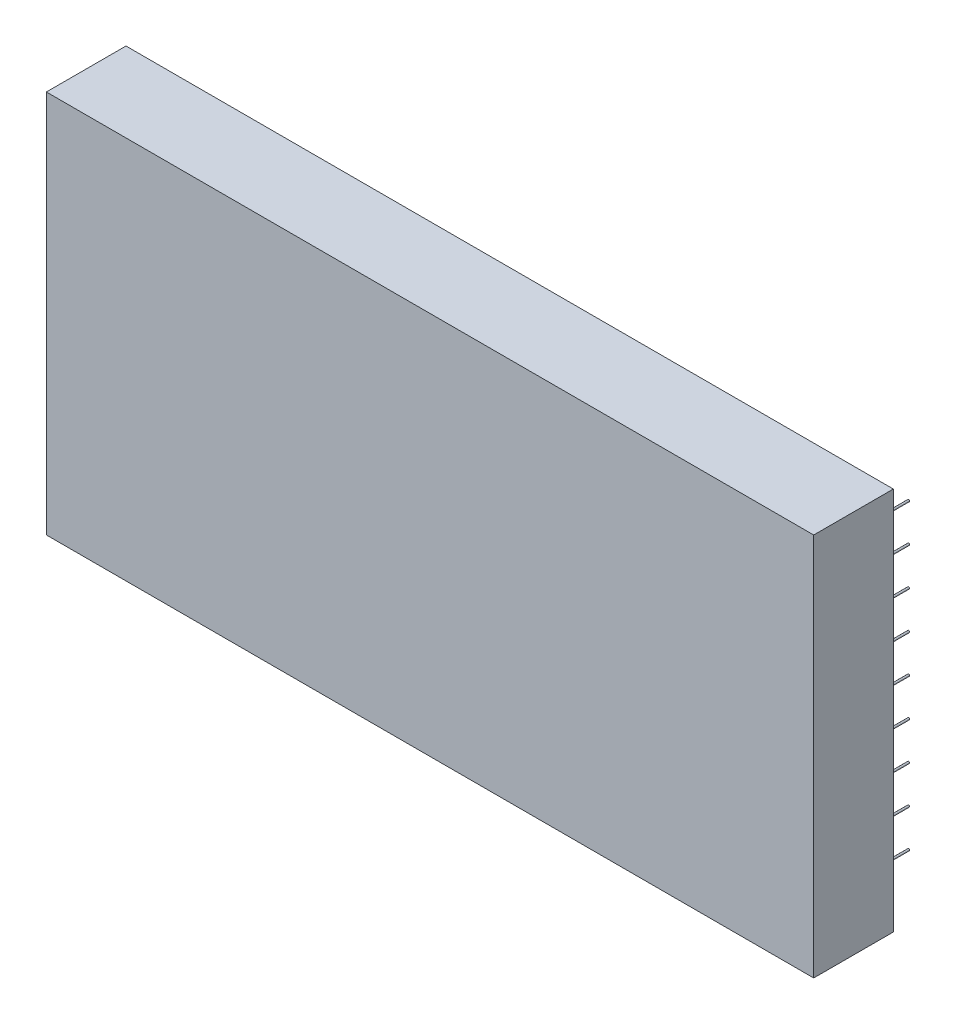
from build123d import *

# Parameters (mm, degrees)
SKETCH_1_W             = 4000
SKETCH_1_H             = 2000
EXTRUDE_1_DEPTH        = 415
CUT_EXTRUDE_1_DEPTH    = 515
SKETCH_4_W             = 600
SKETCH_4_H             = 1320
CUT_EXTRUDE_2_DEPTH    = 400
SKETCH_5_W             = 700
SKETCH_5_H             = 415
EXTRUDE_3_DEPTH        = 15
SKETCH_6_R             = 5
EXTRUDE_4_DEPTH        = 200
SKETCH_8_R             = 22.5
EXTRUDE_5_DEPTH        = 25
SKETCH_10_R            = 17.5
EXTRUDE_6_DEPTH        = 20
SKETCH_11_R            = 12.5
EXTRUDE_7_DEPTH        = 14
SKETCH_12_W            = 40
SKETCH_12_H            = 40
EXTRUDE_8_DEPTH        = 400
SKETCH_13_R            = 15
EXTRUDE_9_DEPTH        = 35
SKETCH_14_R            = 12
EXTRUDE_10_DEPTH       = 40
SKETCH_15_R            = 8
EXTRUDE_11_DEPTH       = 46
CHAMFER_1_SIZE         = 1
SKETCH_16_W            = 400
SKETCH_16_H            = 40
EXTRUDE_12_DEPTH       = 40
EXTRUDE_13_DEPTH       = 300
EXTRUDE_START          = -60
SKETCH_18_R            = 4
EXTRUDE_14_DEPTH       = 5
PATTERN_LINEAR_1_COUNT = 2
PATTERN_LINEAR_1_PITCH = 35
SKETCH_19_R            = 12.5
CUT_EXTRUDE_3_DEPTH    = 62
EXTRUDE_START_2        = 13
SKETCH_20_R            = 7.5
SKETCH_20_R_2          = 4
EXTRUDE_15_DEPTH       = 13
PATTERN_LINEAR_2_COUNT = 2
PATTERN_LINEAR_2_PITCH = 120
SKETCH_22_W            = 22.027184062
SKETCH_22_H            = 64.035334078
CUT_EXTRUDE_4_DEPTH    = 70
SKETCH_23_W            = 15
SKETCH_23_H            = 5
EXTRUDE_17_DEPTH       = 40
SKETCH_24_R            = 3
EXTRUDE_18_DEPTH       = 20
EXTRUDE_START_3        = -5
SKETCH_25_R            = 2.5
EXTRUDE_19_DEPTH       = 5
PATTERN_LINEAR_3_COUNT = 2
PATTERN_LINEAR_3_PITCH = 145
SKETCH_26_R            = 2.5
CUT_EXTRUDE_5_DEPTH    = 59


with BuildPart() as part:
    # Sketch 1 → Extrude 1 (new body)
    with BuildSketch(Plane.XY):
        Rectangle(SKETCH_1_W, SKETCH_1_H)
    extrude(amount=EXTRUDE_1_DEPTH)

    # Sketch 2 → Cut-Extrude 1 (cut)
    with BuildSketch(Plane(origin=(0, -1000, 0), x_dir=(1, 0, 0), z_dir=(0, 1, 0))):
        Polygon((-570, -400), (-370, -400), (-370, -250), (-270, -250), (-270, 0), (-970, 0), (-970, -100), (-870, -100), (-870, -200), (-770, -200), (-770, -300), (-670, -300), (-670, -400), align=None)
    extrude(amount=CUT_EXTRUDE_1_DEPTH, mode=Mode.SUBTRACT)

    # Sketch 4 → Cut-Extrude 2 (cut)
    with BuildSketch(Plane(origin=(0, 0, 0), x_dir=(-1, 0, 0), z_dir=(0, 0, -1))):
        with Locations((570, 175)):
            Rectangle(SKETCH_4_W, SKETCH_4_H)
    extrude(amount=-CUT_EXTRUDE_2_DEPTH, mode=Mode.SUBTRACT)

    # Sketch 5 → Extrude 3 (add)
    with BuildSketch(Plane.XZ.offset(1000)):
        with Locations((-620, 207.5)):
            Rectangle(SKETCH_5_W, SKETCH_5_H)
    extrude(amount=-EXTRUDE_3_DEPTH)

    # Sketch 6 → Extrude 4 (add)
    with BuildSketch(Plane(origin=(0, 0, 0), x_dir=(-1, 0, 0), z_dir=(0, 0, -1))):
        with Locations(Location((-1880, -788, 0), (0, 0, 180))):
            Circle(SKETCH_6_R)
        with Locations(Location((-1880, -591, 0), (0, 0, 180))):
            Circle(SKETCH_6_R)
        with Locations(Location((-1880, -394, 0), (0, 0, 180))):
            Circle(SKETCH_6_R)
        with Locations(Location((-1880, -197, 0), (0, 0, 180))):
            Circle(SKETCH_6_R)
        with Locations(Location((-1880, 0, 0), (0, 0, 180))):
            Circle(SKETCH_6_R)
        with Locations(Location((-1880, 197, 0), (0, 0, 180))):
            Circle(SKETCH_6_R)
        with Locations(Location((-1880, 394, 0), (0, 0, 180))):
            Circle(SKETCH_6_R)
        with Locations(Location((-1880, 591, 0), (0, 0, 180))):
            Circle(SKETCH_6_R)
        with Locations(Location((-1880, 788, 0), (0, 0, 180))):
            Circle(SKETCH_6_R)
    extrude(amount=EXTRUDE_4_DEPTH)

    # Sketch 8 → Extrude 5 (add)
    with BuildSketch(Plane(origin=(0, 0, 0), x_dir=(-1, 0, 0), z_dir=(0, 0, -1))):
        with Locations(Location((-60, 0, 0), (0, 0, 180))):
            Circle(SKETCH_8_R)
    extrude(amount=EXTRUDE_5_DEPTH)

    # Sketch 10 → Extrude 6 (add)
    with BuildSketch(Plane(origin=(0, 0, 0), x_dir=(-1, 0, 0), z_dir=(0, 0, -1))):
        with Locations(Location((-360, 0, 0), (0, 0, 180))):
            Circle(SKETCH_10_R)
    extrude(amount=EXTRUDE_6_DEPTH)

    # Sketch 11 → Extrude 7 (add)
    with BuildSketch(Plane(origin=(0, 0, 0), x_dir=(-1, 0, 0), z_dir=(0, 0, -1))):
        with Locations(Location((-660, 0, 0), (0, 0, 180))):
            Circle(SKETCH_11_R)
    extrude(amount=EXTRUDE_7_DEPTH)

    # Sketch 12 → Extrude 8 (add)
    with BuildSketch(Plane(origin=(0, 0, 0), x_dir=(-1, 0, 0), z_dir=(0, 0, -1))):
        with Locations((-1160, 0)):
            Rectangle(SKETCH_12_W, SKETCH_12_H)
    extrude(amount=EXTRUDE_8_DEPTH)

    # Sketch 13 → Extrude 9 (add)
    with BuildSketch(Plane(origin=(0, 0, -25), x_dir=(-1, 0, 0), z_dir=(0, 0, -1))):
        with Locations((-60, 0)):
            Circle(SKETCH_13_R)
    extrude(amount=EXTRUDE_9_DEPTH)

    # Sketch 14 → Extrude 10 (add)
    with BuildSketch(Plane(origin=(0, 0, -20), x_dir=(-1, 0, 0), z_dir=(0, 0, -1))):
        with Locations((-360, 0)):
            Circle(SKETCH_14_R)
    extrude(amount=EXTRUDE_10_DEPTH)

    # Sketch 15 → Extrude 11 (add)
    with BuildSketch(Plane(origin=(0, 0, -14), x_dir=(-1, 0, 0), z_dir=(0, 0, -1))):
        with Locations((-660, 0)):
            Circle(SKETCH_15_R)
    extrude(amount=EXTRUDE_11_DEPTH)

    # Chamfer 1
    chamfer_1_edges = [part.edges().sort_by_distance(p)[0] for p in [
        (75, 0, -60),
        (372, 0, -60),
        (668, 0, -60),
    ]]
    chamfer(chamfer_1_edges, length=CHAMFER_1_SIZE)

    # Sketch 16 → Extrude 12 (add)
    with BuildSketch(Plane(origin=(0, 0, -400), x_dir=(-1, 0, 0), z_dir=(0, 0, -1))):
        with Locations((-1160, 0)):
            Rectangle(SKETCH_16_W, SKETCH_16_H)
    extrude(amount=EXTRUDE_12_DEPTH)

    # Sketch 17 → Extrude 13 (add)
    with BuildSketch(Plane(origin=(0, 0, 0), x_dir=(-1, 0, 0), z_dir=(0, 0, -1))):
        Polygon((1985, 165), (1985, -165), (1670, -165), (1670, -150), (1970, -150), (1970, 150), (1670, 150), (1670, 165), align=None)
    extrude(amount=EXTRUDE_13_DEPTH)

    # Sketch 18 → Extrude 14 (add)
    with BuildSketch(Plane(origin=(1360, 0, 0), x_dir=(0, 0, -1), z_dir=(1, 0, 0)).offset(EXTRUDE_START)):
        with BuildLine():
            Line((464.409830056, -5), (440, -5))
            Line((440, -5), (440, 5))
            Line((440, 5), (464.409830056, 5))
            ThreePointArc((464.409830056, 5), (477.5, 0), (464.409830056, -5))
        make_face()
        with Locations((470, 0)):
            Circle(SKETCH_18_R, mode=Mode.SUBTRACT)
    extrude_14 = extrude(amount=-EXTRUDE_14_DEPTH)

    # Pattern Linear 1: Extrude 14 ×2
    with Locations(*[(-i * PATTERN_LINEAR_1_PITCH, 0, 0) for i in range(1, PATTERN_LINEAR_1_COUNT)]):
        add(extrude_14)

    # Sketch 19 → Cut-Extrude 3 (cut)
    with BuildSketch(Plane(origin=(0, 0, -440), x_dir=(-1, 0, 0), z_dir=(0, 0, -1))):
        with Locations((-1280, 0)):
            Circle(SKETCH_19_R)
    extrude(amount=-CUT_EXTRUDE_3_DEPTH, mode=Mode.SUBTRACT)

    # Sketch 20 → Extrude 15 (add)
    with BuildSketch(Plane(origin=(1265, 0, 0), x_dir=(0, 0, -1), z_dir=(1, 0, 0)).offset(EXTRUDE_START_2)):
        with Locations((470, 0)):
            Circle(SKETCH_20_R)
        with Locations((470, 0)):
            Circle(SKETCH_20_R_2, mode=Mode.SUBTRACT)
    extrude(amount=-EXTRUDE_15_DEPTH)

    # Pattern Linear 2: Extrude 14 ×2
    with Locations(*[(-i * PATTERN_LINEAR_2_PITCH, 0, 0) for i in range(1, PATTERN_LINEAR_2_COUNT)]):
        add(extrude_14)

    # Sketch 22 → Cut-Extrude 4 (cut)
    with BuildSketch(Plane(origin=(0, 0, -440), x_dir=(-1, 0, 0), z_dir=(0, 0, -1))):
        with Locations((-1297.5, 5)):
            Rectangle(SKETCH_22_W, SKETCH_22_H)
    extrude(amount=CUT_EXTRUDE_4_DEPTH, mode=Mode.SUBTRACT)

    # Sketch 23 → Extrude 17 (add)
    with BuildSketch(Plane(origin=(0, 0, -440), x_dir=(-1, 0, 0), z_dir=(0, 0, -1))):
        with Locations((-987.5, -12.5)):
            Rectangle(SKETCH_23_W, SKETCH_23_H)
    extrude(amount=EXTRUDE_17_DEPTH)

    # Sketch 24 → Extrude 18 (add)
    with BuildSketch(Plane(origin=(0, -10, 0), x_dir=(1, 0, 0), z_dir=(0, 1, 0))):
        with Locations(Location((987.5, 472, 0), (0, 0, 90))):
            Circle(SKETCH_24_R)
    extrude(amount=EXTRUDE_18_DEPTH)

    # Sketch 25 → Extrude 19 (add)
    with BuildSketch(Plane(origin=(1360, 0, 0), x_dir=(0, 0, -1), z_dir=(1, 0, 0)).offset(EXTRUDE_START_3)):
        with BuildLine():
            Line((400, 3), (332.645751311, 3))
            ThreePointArc((332.645751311, 3), (326, 0), (332.645751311, -3))
            Line((332.645751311, -3), (400, -3))
            Line((400, -3), (400, 3))
        make_face()
        with Locations((330, 0)):
            Circle(SKETCH_25_R, mode=Mode.SUBTRACT)
    extrude_19 = extrude(amount=-EXTRUDE_19_DEPTH)

    # Pattern Linear 3: Extrude 19 ×2
    with Locations(*[(-i * PATTERN_LINEAR_3_PITCH, 0, 0) for i in range(1, PATTERN_LINEAR_3_COUNT)]):
        add(extrude_19)

    # Sketch 26 → Cut-Extrude 5 (cut)
    with BuildSketch(Plane(origin=(0, 0, -440), x_dir=(-1, 0, 0), z_dir=(0, 0, -1))):
        with Locations((-987.5, 0)):
            Circle(SKETCH_26_R)
    extrude(amount=-CUT_EXTRUDE_5_DEPTH, mode=Mode.SUBTRACT)


solid = part.part
